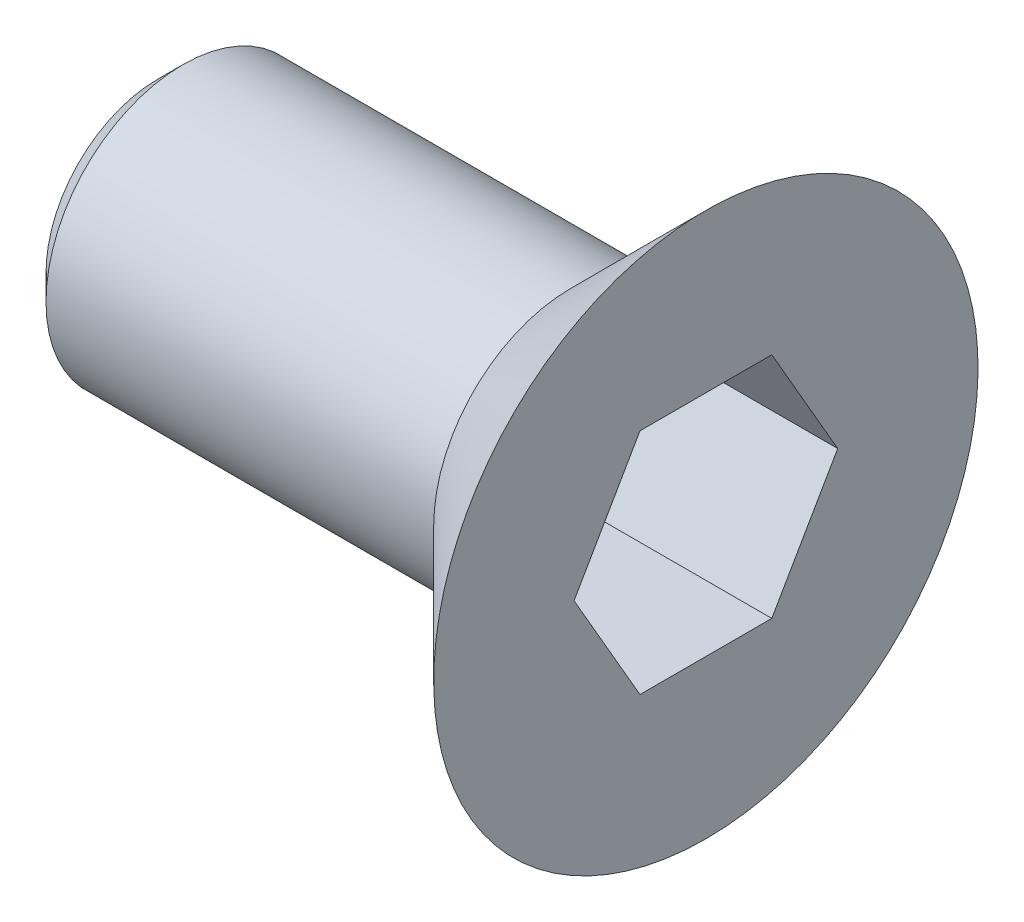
from build123d import *

# Parameters (mm, degrees)
ENL_V_MAT_EXTRU_1_DEPTH = 4
CHANFREIN1_SIZE         = 0.55


with BuildPart() as part:
    # Esquisse1 → Base-R_volution (revolve)
    with BuildSketch(Plane.XY, mode=Mode.PRIVATE) as base_r_volution_sk:
        Polygon((2.047301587, 0), (2.047301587, 3), (11.087301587, 3), (14.047301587, 5.96), (14.047301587, 0), align=None)
    revolve(base_r_volution_sk.sketch.rotate(Axis((-40.583043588, 0, 0), (1, 0, 0)), 180), axis=Axis((-40.583043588, 0, 0), (1, 0, 0)))

    # Esquisse2 → Enl_v. mat.-Extru.1 (cut)
    with BuildSketch(Plane(origin=(14.047301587, 0, 0), x_dir=(0, 0, -1), z_dir=(1, 0, 0))):
        Polygon((2.886751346, 0), (1.443375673, 2.5), (-1.443375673, 2.5), (-2.886751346, 0), (-1.443375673, -2.5), (1.443375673, -2.5), align=None)
    extrude(amount=-ENL_V_MAT_EXTRU_1_DEPTH, mode=Mode.SUBTRACT)

    # Chanfrein1
    chanfrein1_edges = [part.edges().sort_by_distance(p)[0] for p in [
        (2.047301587, 3, 0),
    ]]
    chamfer(chanfrein1_edges, length=CHANFREIN1_SIZE)


solid = part.part
